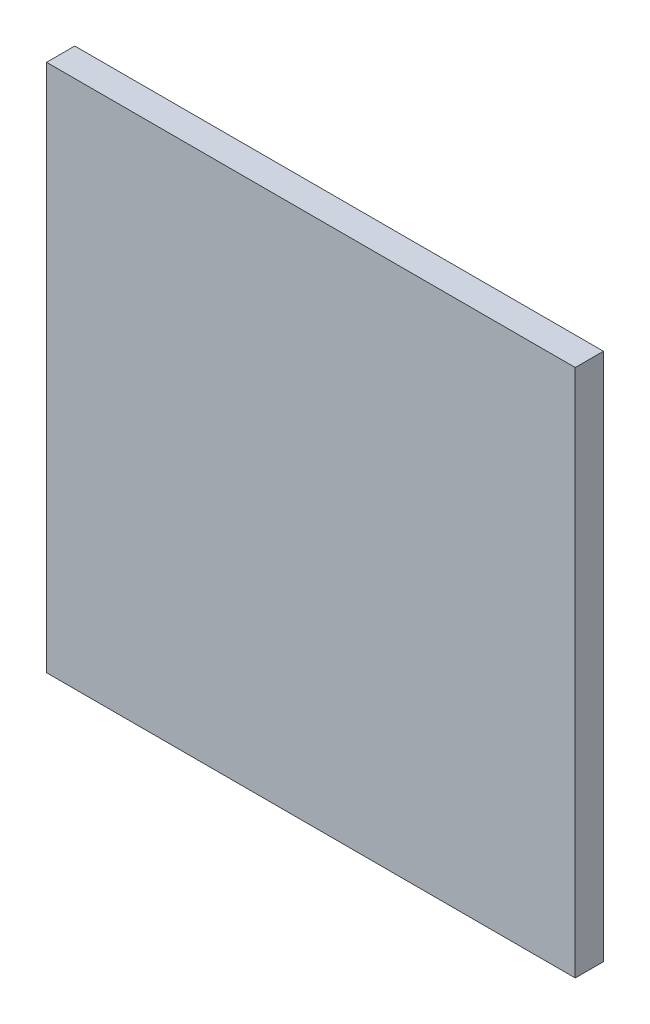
from build123d import *

# Parameters (mm, degrees)
SKETCH_1_W      = 150
SKETCH_1_H      = 150
EXTRUDE_1_DEPTH = 8


with BuildPart() as part:
    # Sketch 1 → Extrude 1 (new body)
    with BuildSketch(Plane.XY):
        Rectangle(SKETCH_1_W, SKETCH_1_H)
    extrude(amount=EXTRUDE_1_DEPTH)


solid = part.part
